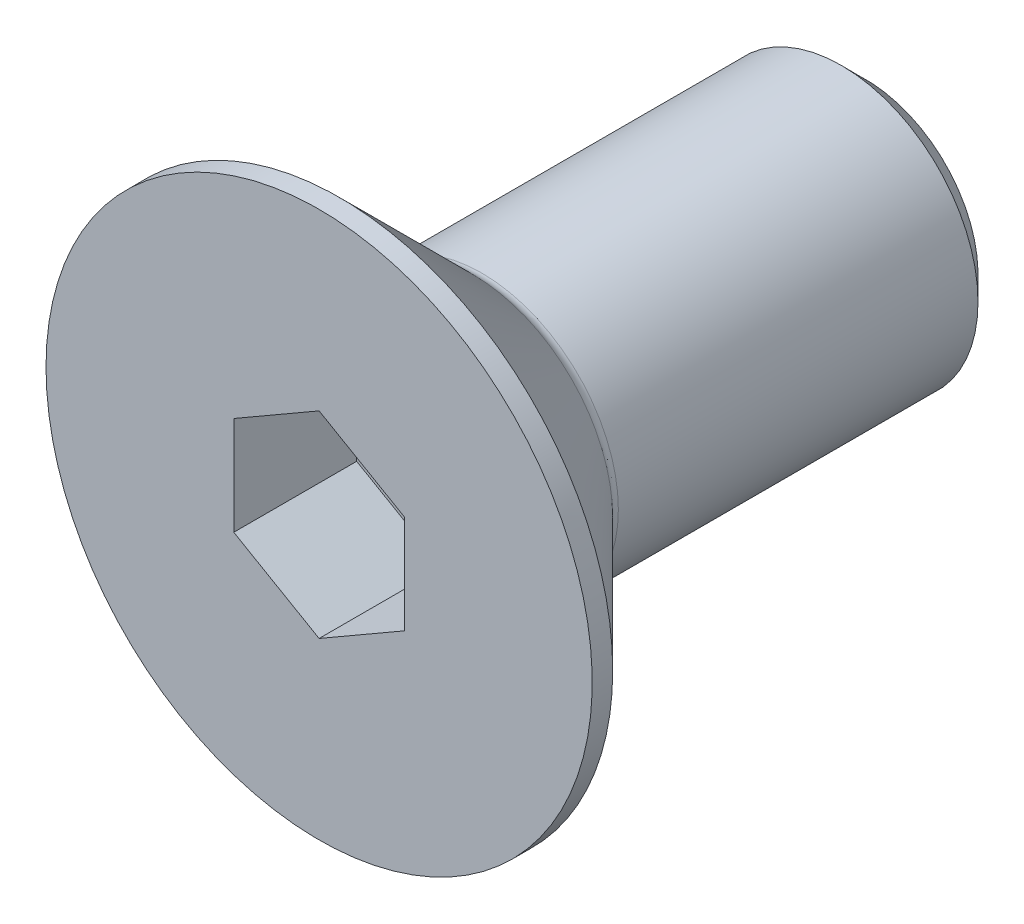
ISO-10303-21;
HEADER;
FILE_DESCRIPTION(('STEP AP214'),'2;1');
FILE_NAME('part.step','',(''),(''),'','','');
FILE_SCHEMA(('AUTOMOTIVE_DESIGN { 1 0 10303 214 1 1 1 1 }'));
ENDSEC;
DATA;
#1=APPLICATION_CONTEXT('core data for automotive mechanical design processes');
#2=APPLICATION_PROTOCOL_DEFINITION('international standard','automotive_design',2000,#1);
#3=PRODUCT_CONTEXT('',#1,'mechanical');
#4=PRODUCT('Part','Part','',(#3));
#5=PRODUCT_RELATED_PRODUCT_CATEGORY('part','',(#4));
#6=PRODUCT_DEFINITION_FORMATION('','',#4);
#7=PRODUCT_DEFINITION_CONTEXT('part definition',#1,'design');
#8=PRODUCT_DEFINITION('design','',#6,#7);
#9=PRODUCT_DEFINITION_SHAPE('','',#8);
#10=(LENGTH_UNIT() NAMED_UNIT(*) SI_UNIT(.MILLI.,.METRE.));
#11=(NAMED_UNIT(*) PLANE_ANGLE_UNIT() SI_UNIT($,.RADIAN.));
#12=(NAMED_UNIT(*) SI_UNIT($,.STERADIAN.) SOLID_ANGLE_UNIT());
#13=UNCERTAINTY_MEASURE_WITH_UNIT(LENGTH_MEASURE(1.E-05),#10,'distance_accuracy_value','');
#14=(GEOMETRIC_REPRESENTATION_CONTEXT(3) GLOBAL_UNCERTAINTY_ASSIGNED_CONTEXT((#13)) GLOBAL_UNIT_ASSIGNED_CONTEXT((#10,
#11,#12)) REPRESENTATION_CONTEXT('',''));
#15=CARTESIAN_POINT('',(0.,0.,0.));
#16=DIRECTION('',(0.,0.,1.));
#17=DIRECTION('',(1.,0.,0.));
#18=AXIS2_PLACEMENT_3D('',#15,#16,#17);
#19=CARTESIAN_POINT('',(0.,1.44337567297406,0.));
#20=DIRECTION('',(-0.5,0.866025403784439,0.));
#21=DIRECTION('',(-0.866025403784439,-0.5,0.));
#22=AXIS2_PLACEMENT_3D('',#19,#20,#21);
#23=PLANE('',#22);
#24=DIRECTION('',(0.,0.,1.));
#25=VECTOR('',#24,1.);
#26=CARTESIAN_POINT('',(0.,1.44337567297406,0.));
#27=LINE('',#26,#25);
#28=CARTESIAN_POINT('',(0.,1.44337567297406,-1.8));
#29=VERTEX_POINT('',#28);
#30=CARTESIAN_POINT('',(0.,1.44337567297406,0.));
#31=VERTEX_POINT('',#30);
#32=EDGE_CURVE('E81',#29,#31,#27,.T.);
#33=ORIENTED_EDGE('',*,*,#32,.T.);
#34=DIRECTION('',(-0.866025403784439,-0.5,0.));
#35=VECTOR('',#34,1.);
#36=CARTESIAN_POINT('',(0.,1.44337567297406,0.));
#37=LINE('',#36,#35);
#38=CARTESIAN_POINT('',(-1.25,0.721687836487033,0.));
#39=VERTEX_POINT('',#38);
#40=EDGE_CURVE('E70',#39,#31,#37,.F.);
#41=ORIENTED_EDGE('',*,*,#40,.F.);
#42=DIRECTION('',(0.,0.,1.));
#43=VECTOR('',#42,1.);
#44=CARTESIAN_POINT('',(-1.25,0.721687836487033,0.));
#45=LINE('',#44,#43);
#46=CARTESIAN_POINT('',(-1.25,0.721687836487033,-1.8));
#47=VERTEX_POINT('',#46);
#48=EDGE_CURVE('E137',#39,#47,#45,.F.);
#49=ORIENTED_EDGE('',*,*,#48,.T.);
#50=DIRECTION('',(-0.866025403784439,-0.5,0.));
#51=VECTOR('',#50,1.);
#52=CARTESIAN_POINT('',(0.,1.44337567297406,-1.8));
#53=LINE('',#52,#51);
#54=EDGE_CURVE('E66',#29,#47,#53,.T.);
#55=ORIENTED_EDGE('',*,*,#54,.F.);
#56=EDGE_LOOP('',(#33,#41,#49,#55));
#57=FACE_BOUND('',#56,.T.);
#58=ADVANCED_FACE('F15',(#57),#23,.F.);
#59=CARTESIAN_POINT('',(1.25,0.721687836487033,0.));
#60=DIRECTION('',(0.499999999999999,0.866025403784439,0.));
#61=DIRECTION('',(-0.866025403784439,0.499999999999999,0.));
#62=AXIS2_PLACEMENT_3D('',#59,#60,#61);
#63=PLANE('',#62);
#64=DIRECTION('',(0.,0.,-1.));
#65=VECTOR('',#64,1.);
#66=CARTESIAN_POINT('',(1.25,0.721687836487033,0.));
#67=LINE('',#66,#65);
#68=CARTESIAN_POINT('',(1.25,0.721687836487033,-1.8));
#69=VERTEX_POINT('',#68);
#70=CARTESIAN_POINT('',(1.25,0.721687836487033,0.));
#71=VERTEX_POINT('',#70);
#72=EDGE_CURVE('E86',#69,#71,#67,.F.);
#73=ORIENTED_EDGE('',*,*,#72,.T.);
#74=DIRECTION('',(-0.866025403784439,0.499999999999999,0.));
#75=VECTOR('',#74,1.);
#76=CARTESIAN_POINT('',(1.25,0.721687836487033,0.));
#77=LINE('',#76,#75);
#78=EDGE_CURVE('E74',#31,#71,#77,.F.);
#79=ORIENTED_EDGE('',*,*,#78,.F.);
#80=ORIENTED_EDGE('',*,*,#32,.F.);
#81=DIRECTION('',(-0.866025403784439,0.499999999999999,0.));
#82=VECTOR('',#81,1.);
#83=CARTESIAN_POINT('',(1.25,0.721687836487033,-1.8));
#84=LINE('',#83,#82);
#85=EDGE_CURVE('E87',#69,#29,#84,.T.);
#86=ORIENTED_EDGE('',*,*,#85,.F.);
#87=EDGE_LOOP('',(#73,#79,#80,#86));
#88=FACE_BOUND('',#87,.T.);
#89=ADVANCED_FACE('F84',(#88),#63,.F.);
#90=CARTESIAN_POINT('',(-1.25,0.721687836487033,0.));
#91=DIRECTION('',(-1.,0.,0.));
#92=DIRECTION('',(0.,0.,1.));
#93=AXIS2_PLACEMENT_3D('',#90,#91,#92);
#94=PLANE('',#93);
#95=ORIENTED_EDGE('',*,*,#48,.F.);
#96=DIRECTION('',(0.,1.,0.));
#97=VECTOR('',#96,1.);
#98=CARTESIAN_POINT('',(-1.25,0.721687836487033,0.));
#99=LINE('',#98,#97);
#100=CARTESIAN_POINT('',(-1.25,-0.721687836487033,0.));
#101=VERTEX_POINT('',#100);
#102=EDGE_CURVE('E77',#101,#39,#99,.T.);
#103=ORIENTED_EDGE('',*,*,#102,.F.);
#104=DIRECTION('',(0.,0.,1.));
#105=VECTOR('',#104,1.);
#106=CARTESIAN_POINT('',(-1.25,-0.721687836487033,0.));
#107=LINE('',#106,#105);
#108=CARTESIAN_POINT('',(-1.25,-0.721687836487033,-1.8));
#109=VERTEX_POINT('',#108);
#110=EDGE_CURVE('E128',#101,#109,#107,.F.);
#111=ORIENTED_EDGE('',*,*,#110,.T.);
#112=DIRECTION('',(0.,1.,0.));
#113=VECTOR('',#112,1.);
#114=CARTESIAN_POINT('',(-1.25,0.721687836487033,-1.8));
#115=LINE('',#114,#113);
#116=EDGE_CURVE('E135',#47,#109,#115,.F.);
#117=ORIENTED_EDGE('',*,*,#116,.F.);
#118=EDGE_LOOP('',(#95,#103,#111,#117));
#119=FACE_BOUND('',#118,.T.);
#120=ADVANCED_FACE('F140',(#119),#94,.F.);
#121=CARTESIAN_POINT('',(1.25,-0.721687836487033,0.));
#122=DIRECTION('',(1.,0.,0.));
#123=DIRECTION('',(0.,0.,-1.));
#124=AXIS2_PLACEMENT_3D('',#121,#122,#123);
#125=PLANE('',#124);
#126=DIRECTION('',(0.,0.,1.));
#127=VECTOR('',#126,1.);
#128=CARTESIAN_POINT('',(1.25,-0.721687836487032,0.));
#129=LINE('',#128,#127);
#130=CARTESIAN_POINT('',(1.25,-0.721687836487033,-1.8));
#131=VERTEX_POINT('',#130);
#132=CARTESIAN_POINT('',(1.25,-0.721687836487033,0.));
#133=VERTEX_POINT('',#132);
#134=EDGE_CURVE('E120',#131,#133,#129,.T.);
#135=ORIENTED_EDGE('',*,*,#134,.T.);
#136=DIRECTION('',(0.,1.,0.));
#137=VECTOR('',#136,1.);
#138=CARTESIAN_POINT('',(1.25,-0.721687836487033,0.));
#139=LINE('',#138,#137);
#140=EDGE_CURVE('E34',#71,#133,#139,.F.);
#141=ORIENTED_EDGE('',*,*,#140,.F.);
#142=ORIENTED_EDGE('',*,*,#72,.F.);
#143=DIRECTION('',(0.,1.,0.));
#144=VECTOR('',#143,1.);
#145=CARTESIAN_POINT('',(1.25,0.,-1.8));
#146=LINE('',#145,#144);
#147=EDGE_CURVE('E122',#131,#69,#146,.T.);
#148=ORIENTED_EDGE('',*,*,#147,.F.);
#149=EDGE_LOOP('',(#135,#141,#142,#148));
#150=FACE_BOUND('',#149,.T.);
#151=ADVANCED_FACE('F147',(#150),#125,.F.);
#152=CARTESIAN_POINT('',(-1.25,-0.721687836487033,0.));
#153=DIRECTION('',(-0.499999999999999,-0.866025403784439,0.));
#154=DIRECTION('',(0.866025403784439,-0.499999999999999,0.));
#155=AXIS2_PLACEMENT_3D('',#152,#153,#154);
#156=PLANE('',#155);
#157=ORIENTED_EDGE('',*,*,#110,.F.);
#158=DIRECTION('',(0.866025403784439,-0.499999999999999,0.));
#159=VECTOR('',#158,1.);
#160=CARTESIAN_POINT('',(-1.25,-0.721687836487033,0.));
#161=LINE('',#160,#159);
#162=CARTESIAN_POINT('',(0.,-1.44337567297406,0.));
#163=VERTEX_POINT('',#162);
#164=EDGE_CURVE('E131',#163,#101,#161,.F.);
#165=ORIENTED_EDGE('',*,*,#164,.F.);
#166=DIRECTION('',(0.,0.,1.));
#167=VECTOR('',#166,1.);
#168=CARTESIAN_POINT('',(0.,-1.44337567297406,0.));
#169=LINE('',#168,#167);
#170=CARTESIAN_POINT('',(0.,-1.44337567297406,-1.8));
#171=VERTEX_POINT('',#170);
#172=EDGE_CURVE('E118',#163,#171,#169,.F.);
#173=ORIENTED_EDGE('',*,*,#172,.T.);
#174=DIRECTION('',(0.866025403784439,-0.499999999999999,0.));
#175=VECTOR('',#174,1.);
#176=CARTESIAN_POINT('',(-1.25,-0.721687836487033,-1.8));
#177=LINE('',#176,#175);
#178=EDGE_CURVE('E125',#109,#171,#177,.T.);
#179=ORIENTED_EDGE('',*,*,#178,.F.);
#180=EDGE_LOOP('',(#157,#165,#173,#179));
#181=FACE_BOUND('',#180,.T.);
#182=ADVANCED_FACE('F154',(#181),#156,.F.);
#183=CARTESIAN_POINT('',(0.,0.,-1.8));
#184=DIRECTION('',(0.,0.,1.));
#185=DIRECTION('',(1.,0.,0.));
#186=AXIS2_PLACEMENT_3D('',#183,#184,#185);
#187=PLANE('',#186);
#188=ORIENTED_EDGE('',*,*,#54,.T.);
#189=ORIENTED_EDGE('',*,*,#116,.T.);
#190=ORIENTED_EDGE('',*,*,#178,.T.);
#191=DIRECTION('',(0.866025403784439,0.5,0.));
#192=VECTOR('',#191,1.);
#193=CARTESIAN_POINT('',(0.,-1.44337567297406,-1.8));
#194=LINE('',#193,#192);
#195=EDGE_CURVE('E115',#171,#131,#194,.T.);
#196=ORIENTED_EDGE('',*,*,#195,.T.);
#197=ORIENTED_EDGE('',*,*,#147,.T.);
#198=ORIENTED_EDGE('',*,*,#85,.T.);
#199=EDGE_LOOP('',(#188,#189,#190,#196,#197,#198));
#200=FACE_BOUND('',#199,.T.);
#201=ADVANCED_FACE('F144',(#200),#187,.T.);
#202=CARTESIAN_POINT('',(0.,-1.44337567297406,0.));
#203=DIRECTION('',(0.5,-0.866025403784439,0.));
#204=DIRECTION('',(0.866025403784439,0.5,0.));
#205=AXIS2_PLACEMENT_3D('',#202,#203,#204);
#206=PLANE('',#205);
#207=ORIENTED_EDGE('',*,*,#172,.F.);
#208=DIRECTION('',(-0.866025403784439,-0.499999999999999,0.));
#209=VECTOR('',#208,1.);
#210=CARTESIAN_POINT('',(1.25,-0.721687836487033,0.));
#211=LINE('',#210,#209);
#212=EDGE_CURVE('E113',#133,#163,#211,.T.);
#213=ORIENTED_EDGE('',*,*,#212,.F.);
#214=ORIENTED_EDGE('',*,*,#134,.F.);
#215=ORIENTED_EDGE('',*,*,#195,.F.);
#216=EDGE_LOOP('',(#207,#213,#214,#215));
#217=FACE_BOUND('',#216,.T.);
#218=ADVANCED_FACE('F152',(#217),#206,.F.);
#219=CARTESIAN_POINT('',(2.,0.,0.));
#220=DIRECTION('',(0.,0.,1.));
#221=DIRECTION('',(1.,0.,0.));
#222=AXIS2_PLACEMENT_3D('',#219,#220,#221);
#223=PLANE('',#222);
#224=ORIENTED_EDGE('',*,*,#140,.T.);
#225=ORIENTED_EDGE('',*,*,#212,.T.);
#226=ORIENTED_EDGE('',*,*,#164,.T.);
#227=ORIENTED_EDGE('',*,*,#102,.T.);
#228=ORIENTED_EDGE('',*,*,#40,.T.);
#229=ORIENTED_EDGE('',*,*,#78,.T.);
#230=EDGE_LOOP('',(#224,#225,#226,#227,#228,#229));
#231=FACE_BOUND('',#230,.T.);
#232=CARTESIAN_POINT('',(0.,0.,0.));
#233=DIRECTION('',(0.,0.,-1.));
#234=DIRECTION('',(-1.,0.,0.));
#235=AXIS2_PLACEMENT_3D('',#232,#233,#234);
#236=CIRCLE('',#235,4.);
#237=CARTESIAN_POINT('',(-4.,0.,0.));
#238=VERTEX_POINT('',#237);
#239=EDGE_CURVE('E19',#238,#238,#236,.T.);
#240=ORIENTED_EDGE('',*,*,#239,.F.);
#241=EDGE_LOOP('',(#240));
#242=FACE_BOUND('',#241,.T.);
#243=ADVANCED_FACE('F71',(#231,#242),#223,.T.);
#244=CARTESIAN_POINT('',(0.,0.,-0.15));
#245=DIRECTION('',(0.,0.,-1.));
#246=DIRECTION('',(-1.,0.,0.));
#247=AXIS2_PLACEMENT_3D('',#244,#245,#246);
#248=CYLINDRICAL_SURFACE('',#247,4.);
#249=ORIENTED_EDGE('',*,*,#239,.T.);
#250=EDGE_LOOP('',(#249));
#251=FACE_BOUND('',#250,.T.);
#252=CARTESIAN_POINT('',(0.,0.,-0.299999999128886));
#253=DIRECTION('',(0.,0.,1.));
#254=DIRECTION('',(1.,0.,0.));
#255=AXIS2_PLACEMENT_3D('',#252,#253,#254);
#256=CIRCLE('',#255,3.99999999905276);
#257=CARTESIAN_POINT('',(3.99999999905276,0.,-0.299999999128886));
#258=VERTEX_POINT('',#257);
#259=EDGE_CURVE('E100',#258,#258,#256,.F.);
#260=ORIENTED_EDGE('',*,*,#259,.F.);
#261=EDGE_LOOP('',(#260));
#262=FACE_BOUND('',#261,.T.);
#263=ADVANCED_FACE('F183',(#251,#262),#248,.T.);
#264=CARTESIAN_POINT('',(0.,0.,-0.299999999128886));
#265=DIRECTION('',(0.,0.,1.));
#266=DIRECTION('',(1.,0.,0.));
#267=AXIS2_PLACEMENT_3D('',#264,#265,#266);
#268=CONICAL_SURFACE('',#267,3.99999999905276,0.78539816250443);
#269=CARTESIAN_POINT('',(0.,0.,-2.24142135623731));
#270=DIRECTION('',(0.,0.,-1.));
#271=DIRECTION('',(0.,1.,0.));
#272=AXIS2_PLACEMENT_3D('',#269,#270,#271);
#273=CIRCLE('',#272,2.05857864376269);
#274=CARTESIAN_POINT('',(0.,2.05857864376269,-2.24142135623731));
#275=VERTEX_POINT('',#274);
#276=EDGE_CURVE('E94',#275,#275,#273,.T.);
#277=ORIENTED_EDGE('',*,*,#276,.F.);
#278=EDGE_LOOP('',(#277));
#279=FACE_BOUND('',#278,.T.);
#280=ORIENTED_EDGE('',*,*,#259,.T.);
#281=EDGE_LOOP('',(#280));
#282=FACE_BOUND('',#281,.T.);
#283=ADVANCED_FACE('F179',(#279,#282),#268,.T.);
#284=CARTESIAN_POINT('',(1.,0.,-8.));
#285=DIRECTION('',(0.,0.,-1.));
#286=DIRECTION('',(-1.,0.,0.));
#287=AXIS2_PLACEMENT_3D('',#284,#285,#286);
#288=PLANE('',#287);
#289=CARTESIAN_POINT('',(0.,0.,-8.00000000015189));
#290=DIRECTION('',(0.,0.,1.));
#291=DIRECTION('',(0.,-1.,0.));
#292=AXIS2_PLACEMENT_3D('',#289,#290,#291);
#293=CIRCLE('',#292,1.65000000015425);
#294=CARTESIAN_POINT('',(0.,-1.65000000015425,-8.00000000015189));
#295=VERTEX_POINT('',#294);
#296=EDGE_CURVE('E92',#295,#295,#293,.T.);
#297=ORIENTED_EDGE('',*,*,#296,.F.);
#298=EDGE_LOOP('',(#297));
#299=FACE_BOUND('',#298,.T.);
#300=ADVANCED_FACE('F176',(#299),#288,.T.);
#301=CARTESIAN_POINT('',(0.,0.,-2.38284271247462));
#302=DIRECTION('',(0.,0.,-1.));
#303=DIRECTION('',(0.,1.,0.));
#304=AXIS2_PLACEMENT_3D('',#301,#302,#303);
#305=TOROIDAL_SURFACE('',#304,2.2,0.2);
#306=CARTESIAN_POINT('',(0.,0.,-2.38284271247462));
#307=DIRECTION('',(0.,0.,-1.));
#308=DIRECTION('',(-1.,0.,0.));
#309=AXIS2_PLACEMENT_3D('',#306,#307,#308);
#310=CIRCLE('',#309,2.);
#311=CARTESIAN_POINT('',(-2.,0.,-2.38284271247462));
#312=VERTEX_POINT('',#311);
#313=EDGE_CURVE('E25',#312,#312,#310,.T.);
#314=ORIENTED_EDGE('',*,*,#313,.F.);
#315=EDGE_LOOP('',(#314));
#316=FACE_BOUND('',#315,.T.);
#317=ORIENTED_EDGE('',*,*,#276,.T.);
#318=EDGE_LOOP('',(#317));
#319=FACE_BOUND('',#318,.T.);
#320=ADVANCED_FACE('F17',(#316,#319),#305,.F.);
#321=CARTESIAN_POINT('',(0.,0.,-7.64999999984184));
#322=DIRECTION('',(0.,0.,1.));
#323=DIRECTION('',(0.,-1.,0.));
#324=AXIS2_PLACEMENT_3D('',#321,#322,#323);
#325=CONICAL_SURFACE('',#324,1.99999999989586,0.7853981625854);
#326=ORIENTED_EDGE('',*,*,#296,.T.);
#327=EDGE_LOOP('',(#326));
#328=FACE_BOUND('',#327,.T.);
#329=CARTESIAN_POINT('',(0.,0.,-7.65));
#330=DIRECTION('',(0.,0.,-1.));
#331=DIRECTION('',(-1.,0.,0.));
#332=AXIS2_PLACEMENT_3D('',#329,#330,#331);
#333=CIRCLE('',#332,2.);
#334=CARTESIAN_POINT('',(-2.,0.,-7.65));
#335=VERTEX_POINT('',#334);
#336=EDGE_CURVE('E10',#335,#335,#333,.F.);
#337=ORIENTED_EDGE('',*,*,#336,.F.);
#338=EDGE_LOOP('',(#337));
#339=FACE_BOUND('',#338,.T.);
#340=ADVANCED_FACE('F166',(#328,#339),#325,.T.);
#341=CARTESIAN_POINT('',(0.,0.,-5.15));
#342=DIRECTION('',(0.,0.,-1.));
#343=DIRECTION('',(-1.,0.,0.));
#344=AXIS2_PLACEMENT_3D('',#341,#342,#343);
#345=CYLINDRICAL_SURFACE('',#344,2.);
#346=ORIENTED_EDGE('',*,*,#336,.T.);
#347=EDGE_LOOP('',(#346));
#348=FACE_BOUND('',#347,.T.);
#349=ORIENTED_EDGE('',*,*,#313,.T.);
#350=EDGE_LOOP('',(#349));
#351=FACE_BOUND('',#350,.T.);
#352=ADVANCED_FACE('F164',(#348,#351),#345,.T.);
#353=CLOSED_SHELL('',(#58,#89,#120,#151,#182,#201,#218,#243,#263,#283,#300,#320,#340,#352));
#354=MANIFOLD_SOLID_BREP('B1',#353);
#355=ADVANCED_BREP_SHAPE_REPRESENTATION('',(#18,#354),#14);
#356=SHAPE_DEFINITION_REPRESENTATION(#9,#355);
ENDSEC;
END-ISO-10303-21;
